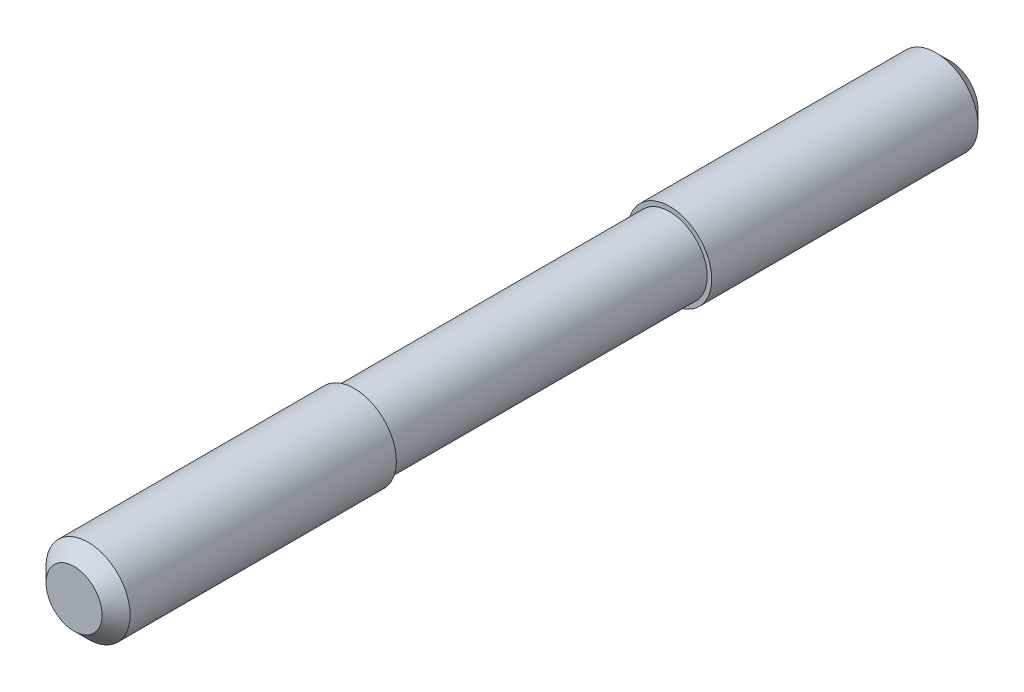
ISO-10303-21;
HEADER;
FILE_DESCRIPTION(('STEP AP214'),'2;1');
FILE_NAME('part.step','',(''),(''),'','','');
FILE_SCHEMA(('AUTOMOTIVE_DESIGN { 1 0 10303 214 1 1 1 1 }'));
ENDSEC;
DATA;
#1=APPLICATION_CONTEXT('core data for automotive mechanical design processes');
#2=APPLICATION_PROTOCOL_DEFINITION('international standard','automotive_design',2000,#1);
#3=PRODUCT_CONTEXT('',#1,'mechanical');
#4=PRODUCT('Part','Part','',(#3));
#5=PRODUCT_RELATED_PRODUCT_CATEGORY('part','',(#4));
#6=PRODUCT_DEFINITION_FORMATION('','',#4);
#7=PRODUCT_DEFINITION_CONTEXT('part definition',#1,'design');
#8=PRODUCT_DEFINITION('design','',#6,#7);
#9=PRODUCT_DEFINITION_SHAPE('','',#8);
#10=(LENGTH_UNIT() NAMED_UNIT(*) SI_UNIT(.MILLI.,.METRE.));
#11=(NAMED_UNIT(*) PLANE_ANGLE_UNIT() SI_UNIT($,.RADIAN.));
#12=(NAMED_UNIT(*) SI_UNIT($,.STERADIAN.) SOLID_ANGLE_UNIT());
#13=UNCERTAINTY_MEASURE_WITH_UNIT(LENGTH_MEASURE(1.E-05),#10,'distance_accuracy_value','');
#14=(GEOMETRIC_REPRESENTATION_CONTEXT(3) GLOBAL_UNCERTAINTY_ASSIGNED_CONTEXT((#13)) GLOBAL_UNIT_ASSIGNED_CONTEXT((#10,
#11,#12)) REPRESENTATION_CONTEXT('',''));
#15=CARTESIAN_POINT('',(0.,0.,0.));
#16=DIRECTION('',(0.,0.,1.));
#17=DIRECTION('',(1.,0.,0.));
#18=AXIS2_PLACEMENT_3D('',#15,#16,#17);
#19=CARTESIAN_POINT('',(0.,0.,0.));
#20=DIRECTION('',(0.,0.,1.));
#21=DIRECTION('',(1.,0.,0.));
#22=AXIS2_PLACEMENT_3D('',#19,#20,#21);
#23=PLANE('',#22);
#24=CARTESIAN_POINT('',(0.,0.,0.));
#25=DIRECTION('',(0.,0.,1.));
#26=DIRECTION('',(1.,0.,0.));
#27=AXIS2_PLACEMENT_3D('',#24,#25,#26);
#28=CIRCLE('',#27,4.);
#29=CARTESIAN_POINT('',(4.,0.,0.));
#30=VERTEX_POINT('',#29);
#31=EDGE_CURVE('E8',#30,#30,#28,.T.);
#32=ORIENTED_EDGE('',*,*,#31,.F.);
#33=EDGE_LOOP('',(#32));
#34=FACE_BOUND('',#33,.T.);
#35=ADVANCED_FACE('F12',(#34),#23,.F.);
#36=CARTESIAN_POINT('',(0.,0.,2.));
#37=DIRECTION('',(0.,0.,1.));
#38=DIRECTION('',(1.,0.,0.));
#39=AXIS2_PLACEMENT_3D('',#36,#37,#38);
#40=CONICAL_SURFACE('',#39,6.,0.785398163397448);
#41=ORIENTED_EDGE('',*,*,#31,.T.);
#42=EDGE_LOOP('',(#41));
#43=FACE_BOUND('',#42,.T.);
#44=CARTESIAN_POINT('',(0.,0.,2.));
#45=DIRECTION('',(0.,0.,1.));
#46=DIRECTION('',(1.,0.,0.));
#47=AXIS2_PLACEMENT_3D('',#44,#45,#46);
#48=CIRCLE('',#47,6.);
#49=CARTESIAN_POINT('',(6.,0.,2.));
#50=VERTEX_POINT('',#49);
#51=EDGE_CURVE('E18',#50,#50,#48,.T.);
#52=ORIENTED_EDGE('',*,*,#51,.F.);
#53=EDGE_LOOP('',(#52));
#54=FACE_BOUND('',#53,.T.);
#55=ADVANCED_FACE('F61',(#43,#54),#40,.T.);
#56=CARTESIAN_POINT('',(0.,0.,70.));
#57=DIRECTION('',(0.,0.,1.));
#58=DIRECTION('',(1.,0.,0.));
#59=AXIS2_PLACEMENT_3D('',#56,#57,#58);
#60=CYLINDRICAL_SURFACE('',#59,6.);
#61=CARTESIAN_POINT('',(0.,0.,40.));
#62=DIRECTION('',(0.,0.,1.));
#63=DIRECTION('',(1.,0.,0.));
#64=AXIS2_PLACEMENT_3D('',#61,#62,#63);
#65=CIRCLE('',#64,6.);
#66=CARTESIAN_POINT('',(6.,0.,40.));
#67=VERTEX_POINT('',#66);
#68=EDGE_CURVE('E22',#67,#67,#65,.T.);
#69=ORIENTED_EDGE('',*,*,#68,.F.);
#70=EDGE_LOOP('',(#69));
#71=FACE_BOUND('',#70,.T.);
#72=ORIENTED_EDGE('',*,*,#51,.T.);
#73=EDGE_LOOP('',(#72));
#74=FACE_BOUND('',#73,.T.);
#75=ADVANCED_FACE('F66',(#71,#74),#60,.T.);
#76=CARTESIAN_POINT('',(6.,0.,40.));
#77=DIRECTION('',(0.,0.,-1.));
#78=DIRECTION('',(-1.,0.,0.));
#79=AXIS2_PLACEMENT_3D('',#76,#77,#78);
#80=PLANE('',#79);
#81=CARTESIAN_POINT('',(0.,0.,40.));
#82=DIRECTION('',(0.,0.,1.));
#83=DIRECTION('',(1.,0.,0.));
#84=AXIS2_PLACEMENT_3D('',#81,#82,#83);
#85=CIRCLE('',#84,5.35);
#86=CARTESIAN_POINT('',(5.35,0.,40.));
#87=VERTEX_POINT('',#86);
#88=EDGE_CURVE('E26',#87,#87,#85,.T.);
#89=ORIENTED_EDGE('',*,*,#88,.F.);
#90=EDGE_LOOP('',(#89));
#91=FACE_BOUND('',#90,.T.);
#92=ORIENTED_EDGE('',*,*,#68,.T.);
#93=EDGE_LOOP('',(#92));
#94=FACE_BOUND('',#93,.T.);
#95=ADVANCED_FACE('F70',(#91,#94),#80,.F.);
#96=CARTESIAN_POINT('',(0.,0.,70.));
#97=DIRECTION('',(0.,0.,1.));
#98=DIRECTION('',(1.,0.,0.));
#99=AXIS2_PLACEMENT_3D('',#96,#97,#98);
#100=CYLINDRICAL_SURFACE('',#99,5.35);
#101=CARTESIAN_POINT('',(0.,0.,85.));
#102=DIRECTION('',(0.,0.,1.));
#103=DIRECTION('',(1.,0.,0.));
#104=AXIS2_PLACEMENT_3D('',#101,#102,#103);
#105=CIRCLE('',#104,5.35);
#106=CARTESIAN_POINT('',(5.35,0.,85.));
#107=VERTEX_POINT('',#106);
#108=EDGE_CURVE('E31',#107,#107,#105,.T.);
#109=ORIENTED_EDGE('',*,*,#108,.F.);
#110=EDGE_LOOP('',(#109));
#111=FACE_BOUND('',#110,.T.);
#112=ORIENTED_EDGE('',*,*,#88,.T.);
#113=EDGE_LOOP('',(#112));
#114=FACE_BOUND('',#113,.T.);
#115=ADVANCED_FACE('F77',(#111,#114),#100,.T.);
#116=CARTESIAN_POINT('',(5.35,0.,85.));
#117=DIRECTION('',(0.,0.,1.));
#118=DIRECTION('',(1.,0.,0.));
#119=AXIS2_PLACEMENT_3D('',#116,#117,#118);
#120=PLANE('',#119);
#121=CARTESIAN_POINT('',(0.,0.,85.));
#122=DIRECTION('',(0.,0.,1.));
#123=DIRECTION('',(1.,0.,0.));
#124=AXIS2_PLACEMENT_3D('',#121,#122,#123);
#125=CIRCLE('',#124,6.);
#126=CARTESIAN_POINT('',(6.,0.,85.));
#127=VERTEX_POINT('',#126);
#128=EDGE_CURVE('E34',#127,#127,#125,.T.);
#129=ORIENTED_EDGE('',*,*,#128,.F.);
#130=EDGE_LOOP('',(#129));
#131=FACE_BOUND('',#130,.T.);
#132=ORIENTED_EDGE('',*,*,#108,.T.);
#133=EDGE_LOOP('',(#132));
#134=FACE_BOUND('',#133,.T.);
#135=ADVANCED_FACE('F57',(#131,#134),#120,.F.);
#136=CARTESIAN_POINT('',(0.,0.,70.));
#137=DIRECTION('',(0.,0.,1.));
#138=DIRECTION('',(1.,0.,0.));
#139=AXIS2_PLACEMENT_3D('',#136,#137,#138);
#140=CYLINDRICAL_SURFACE('',#139,6.);
#141=CARTESIAN_POINT('',(0.,0.,123.));
#142=DIRECTION('',(0.,0.,1.));
#143=DIRECTION('',(1.,0.,0.));
#144=AXIS2_PLACEMENT_3D('',#141,#142,#143);
#145=CIRCLE('',#144,6.);
#146=CARTESIAN_POINT('',(6.,0.,123.));
#147=VERTEX_POINT('',#146);
#148=EDGE_CURVE('E37',#147,#147,#145,.T.);
#149=ORIENTED_EDGE('',*,*,#148,.F.);
#150=EDGE_LOOP('',(#149));
#151=FACE_BOUND('',#150,.T.);
#152=ORIENTED_EDGE('',*,*,#128,.T.);
#153=EDGE_LOOP('',(#152));
#154=FACE_BOUND('',#153,.T.);
#155=ADVANCED_FACE('F48',(#151,#154),#140,.T.);
#156=CARTESIAN_POINT('',(0.,0.,125.));
#157=DIRECTION('',(0.,0.,-1.));
#158=DIRECTION('',(-1.,0.,0.));
#159=AXIS2_PLACEMENT_3D('',#156,#157,#158);
#160=CONICAL_SURFACE('',#159,4.,0.785398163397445);
#161=ORIENTED_EDGE('',*,*,#148,.T.);
#162=EDGE_LOOP('',(#161));
#163=FACE_BOUND('',#162,.T.);
#164=CARTESIAN_POINT('',(0.,0.,125.));
#165=DIRECTION('',(0.,0.,1.));
#166=DIRECTION('',(1.,0.,0.));
#167=AXIS2_PLACEMENT_3D('',#164,#165,#166);
#168=CIRCLE('',#167,4.);
#169=CARTESIAN_POINT('',(4.,0.,125.));
#170=VERTEX_POINT('',#169);
#171=EDGE_CURVE('E40',#170,#170,#168,.T.);
#172=ORIENTED_EDGE('',*,*,#171,.F.);
#173=EDGE_LOOP('',(#172));
#174=FACE_BOUND('',#173,.T.);
#175=ADVANCED_FACE('F46',(#163,#174),#160,.T.);
#176=CARTESIAN_POINT('',(4.,0.,125.));
#177=DIRECTION('',(0.,0.,-1.));
#178=DIRECTION('',(-1.,0.,0.));
#179=AXIS2_PLACEMENT_3D('',#176,#177,#178);
#180=PLANE('',#179);
#181=ORIENTED_EDGE('',*,*,#171,.T.);
#182=EDGE_LOOP('',(#181));
#183=FACE_BOUND('',#182,.T.);
#184=ADVANCED_FACE('F44',(#183),#180,.F.);
#185=CLOSED_SHELL('',(#35,#55,#75,#95,#115,#135,#155,#175,#184));
#186=MANIFOLD_SOLID_BREP('B1',#185);
#187=ADVANCED_BREP_SHAPE_REPRESENTATION('',(#18,#186),#14);
#188=SHAPE_DEFINITION_REPRESENTATION(#9,#187);
ENDSEC;
END-ISO-10303-21;
